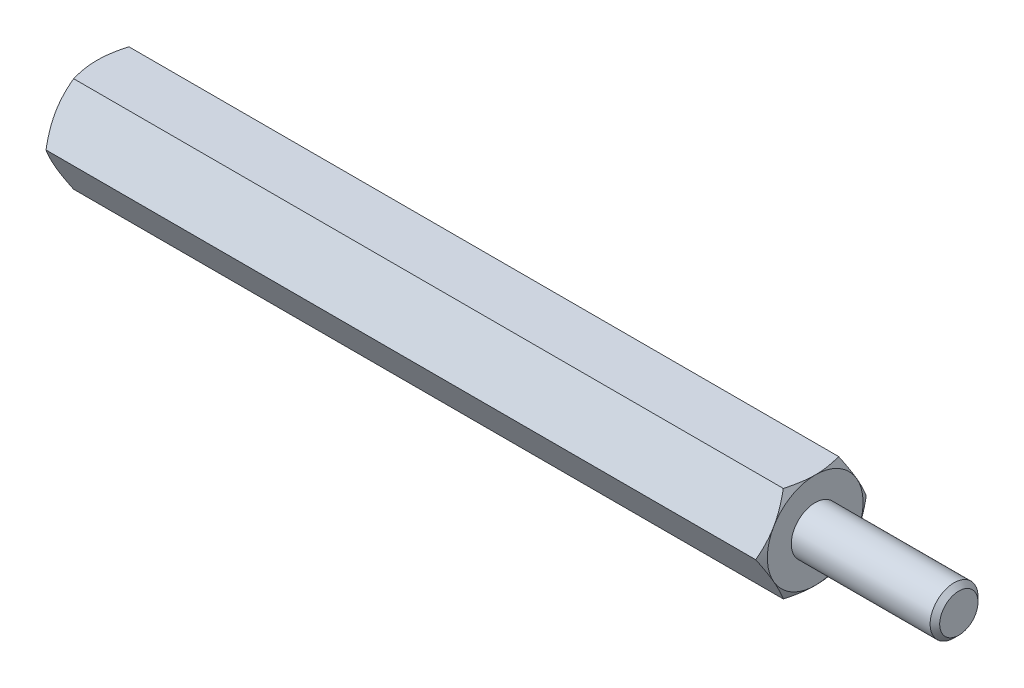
from build123d import *

# Parameters (mm, degrees)
EXTRUDE2_DEPTH = 15
SKETCH3_R      = 0.8
EXTRUDE3_DEPTH = 6
SKETCH5_R      = 1
EXTRUDE4_DEPTH = 6
CHAMFER1_SIZE  = 0.2


with BuildPart() as part:
    # Sketch1 → Extrude2 (new, symmetric)
    with BuildSketch(Plane(origin=(0, 0, 0), x_dir=(0, 0, -1), z_dir=(1, 0, 0))):
        Polygon((1.154700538, 2), (-1.154700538, 2), (-2.309401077, 0), (-1.154700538, -2), (1.154700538, -2), (2.309401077, 0), align=None)
    extrude(amount=EXTRUDE2_DEPTH, both=True)

    # Sketch2 → Cut-Revolve1 (revolve, cut)
    with BuildSketch(Plane.XY):
        with BuildLine():
            Line((-15, 2), (-13.5, 4.598076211))
            ThreePointArc((-13.5, 4.598076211), (-13.98810136, 5.776457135), (-15, 5))
            Line((-15, 5), (-15, 2))
        make_face()
    cut_revolve1 = revolve(axis=Axis((0, 0, 0), (1, 0, 0)), mode=Mode.SUBTRACT)

    # Mirror1: Cut-Revolve1 across plane
    add(cut_revolve1.mirror(Plane(origin=(0, 0, 0), x_dir=(0, 0, 1), z_dir=(1, 0, 0))), mode=Mode.SUBTRACT)

    # Sketch3 → Extrude3 (cut)
    with BuildSketch(Plane.ZY.offset(15)):
        Circle(SKETCH3_R)
    extrude(amount=-EXTRUDE3_DEPTH, mode=Mode.SUBTRACT)

    # Sketch4 → Cut-Revolve2 (revolve, cut)
    with BuildSketch(Plane.XY, mode=Mode.PRIVATE) as cut_revolve2_sk:
        Polygon((-9, 0), (-9, 0.8), (-8.538119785, 0), align=None)
    revolve(cut_revolve2_sk.sketch.rotate(Axis((-8.538119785, 0, 0), (-1, 0, 0)), 270), axis=Axis((-8.538119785, 0, 0), (-1, 0, 0)), mode=Mode.SUBTRACT)

    # Sketch5 → Extrude4 (add)
    with BuildSketch(Plane(origin=(15, 0, 0), x_dir=(0, 0, -1), z_dir=(1, 0, 0))):
        Circle(SKETCH5_R)
    extrude(amount=EXTRUDE4_DEPTH)

    # Chamfer1
    chamfer1_edges = [part.edges().sort_by_distance(p)[0] for p in [
        (21, 0, 1),
    ]]
    chamfer(chamfer1_edges, length=CHAMFER1_SIZE)


solid = part.part
